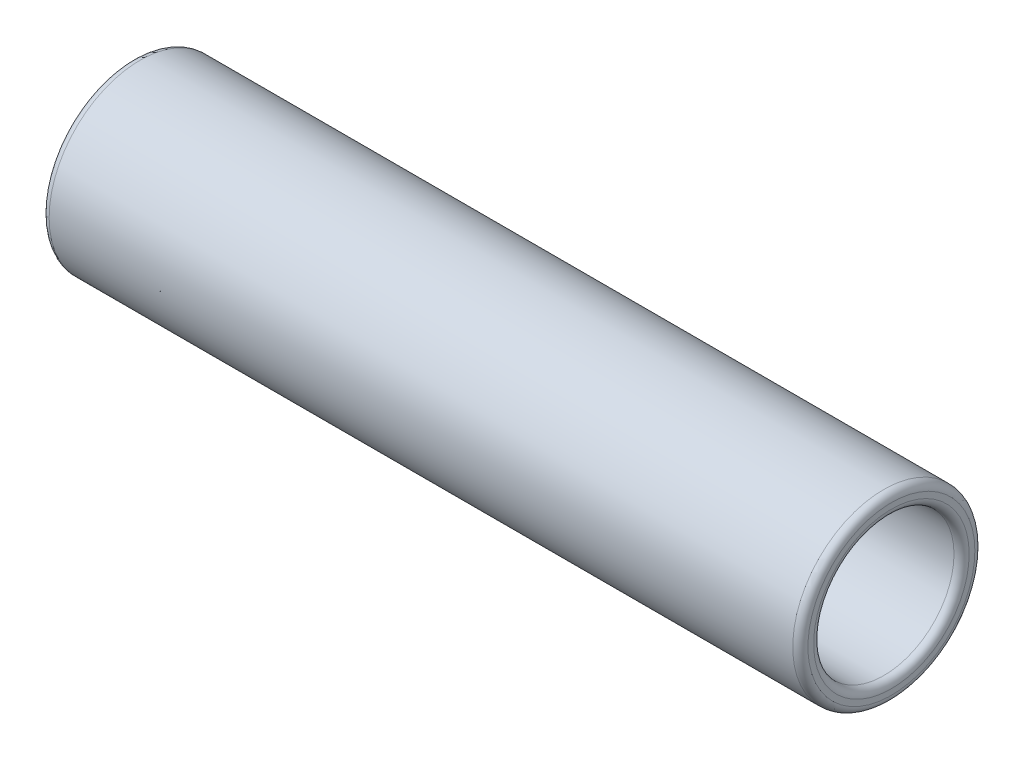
from build123d import *

# Parameters (mm, degrees)
ESQUISSE1_W = 10
ESQUISSE1_H = 0.275
CONG_1_R    = 0.1


with BuildPart() as part:
    # Esquisse1 → R_volution1 (revolve)
    with BuildSketch(Plane.XY, mode=Mode.PRIVATE) as r_volution1_sk:
        with Locations((2.129178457, 1.0625)):
            Rectangle(ESQUISSE1_W, ESQUISSE1_H)
    revolve(r_volution1_sk.sketch.rotate(Axis((0, 0, 0), (-1, 0, 0)), 90), axis=Axis((0, 0, 0), (-1, 0, 0)))

    # Cong_1
    cong_1_edges = [part.edges().sort_by_distance(p)[0] for p in [
        (7.129178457, 0, 0.925),
        (-2.870821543, 0, 0.925),
        (-2.870821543, 0, 1.2),
        (7.129178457, 0, 1.2),
    ]]
    fillet(cong_1_edges, radius=CONG_1_R)


solid = part.part
